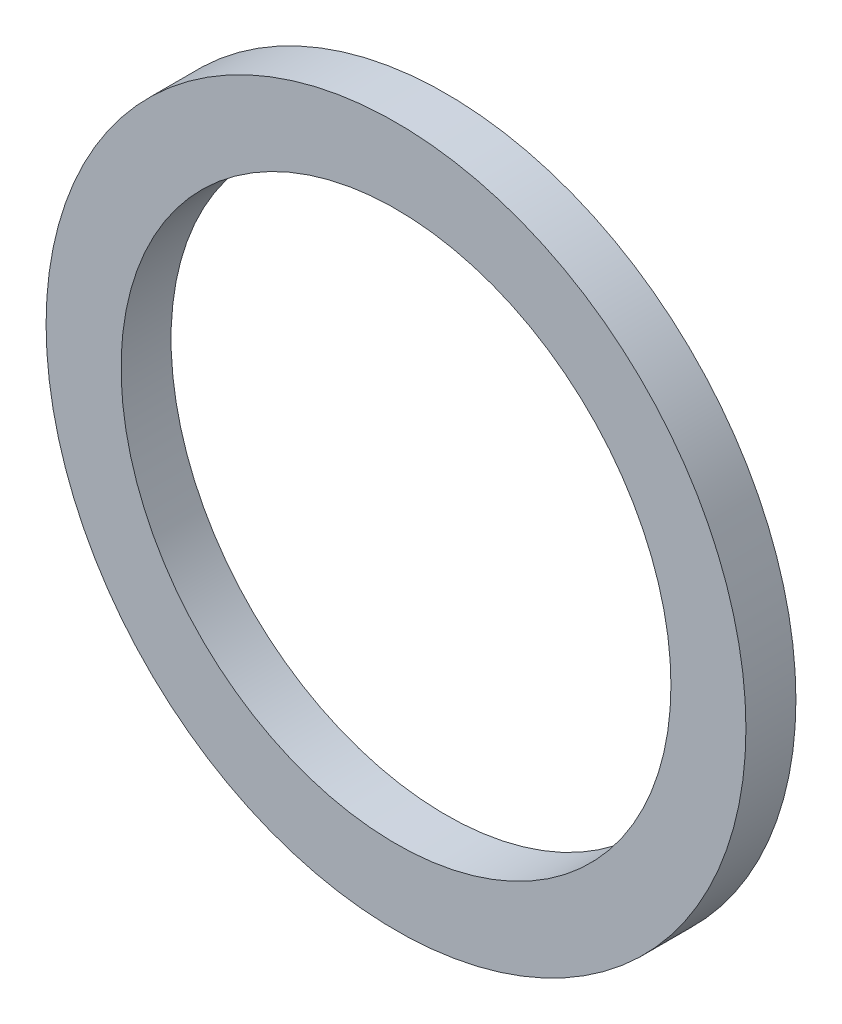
from build123d import *

# Parameters (mm, degrees)
ESQUISSE1_W = 5
ESQUISSE1_H = 7.5


with BuildPart() as part:
    # Esquisse1 → R_volution1 (revolve)
    with BuildSketch(Plane(origin=(0, 0, 0), x_dir=(0, 0, -1), z_dir=(1, 0, 0)), mode=Mode.PRIVATE) as r_volution1_sk:
        with Locations((2.5, 31.25)):
            Rectangle(ESQUISSE1_W, ESQUISSE1_H)
    revolve(r_volution1_sk.sketch.rotate(Axis((0, 0, 0), (0, 0, -1)), 90), axis=Axis((0, 0, 0), (0, 0, -1)))


solid = part.part
